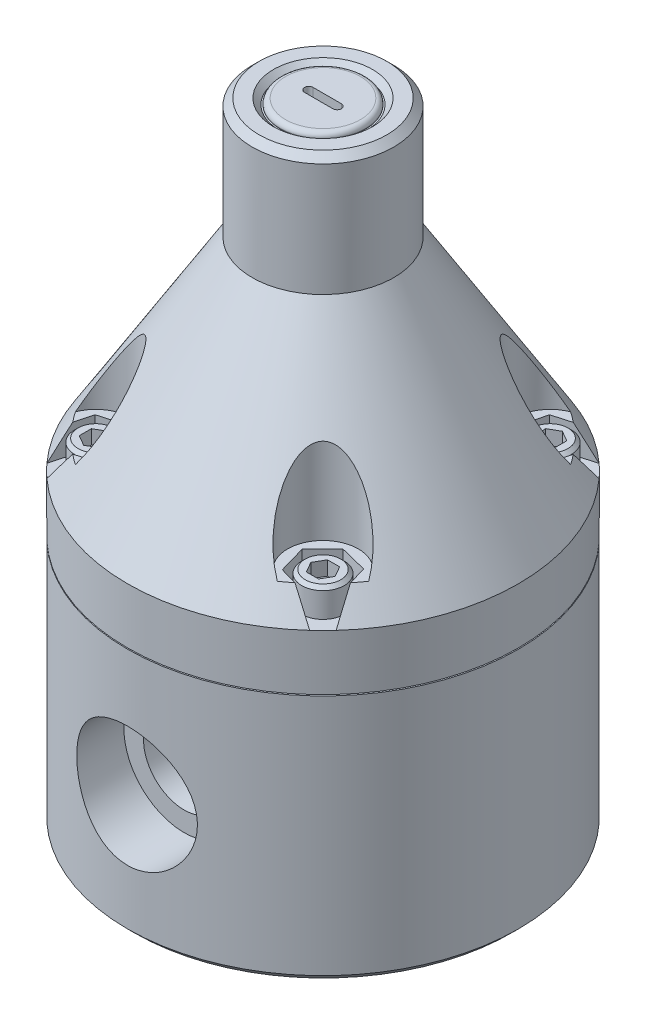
from build123d import *

# Parameters (mm, degrees)
SKETCH1_R         = 43.815
EXTRUDE1_DEPTH    = 140.97
SKETCH3_R         = 11.1125
EXTRUDE2_DEPTH    = 1.27
EXTRUDE2_DRAFT    = -45
CHAMFER1_SIZE     = 1.5748
SKETCH4_R         = 9.525
EXTRUDE3_DEPTH    = 1.27
FILLET1_R         = 1.143
EXTRUDE4_DEPTH    = 3.302
EXTRUDE4_DRAFT    = -1
SKETCH6_R         = 7.9375
EXTRUDE5_DEPTH    = 22.86
EXTRUDE6_DEPTH    = 6.35
CIRPATTERN1_COUNT = 4
SKETCH9_R         = 4.7625
EXTRUDE7_DEPTH    = 6.35
EXTRUDE8_DEPTH    = 3.175
CIRPATTERN2_COUNT = 4
CHAMFER2_SIZE     = 0.762


with BuildPart() as part:
    # Sketch1 → Extrude1 (new body)
    with BuildSketch(Plane(origin=(0, 0, 0), x_dir=(1, 0, 0), z_dir=(0, 1, 0))):
        with Locations(Location((0, 0, 0), (0, 0, 270))):
            Circle(SKETCH1_R)
    extrude(amount=EXTRUDE1_DEPTH)

    # Sketch2 → Cut-Revolve1 (revolve, cut)
    with BuildSketch(Plane.XY, mode=Mode.PRIVATE) as cut_revolve1_sk:
        Polygon((-43.815, 56.134), (-43.815, 68.58), (-15.875, 114.046), (-15.875, 147.034008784), (-49.44729897, 147.034008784), (-49.44729897, 55.88), (-30.226, 55.88), (-30.226, 56.134), align=None)
    revolve(cut_revolve1_sk.sketch.rotate(Axis((0, 0, 0), (0, 1, 0)), 270), axis=Axis((0, 0, 0), (0, 1, 0)), mode=Mode.SUBTRACT)


with BuildPart() as extrude2_tool:
    # Sketch3 → Extrude2 (with draft: the straight prism first)
    with BuildSketch(Plane(origin=(0, 140.97, 0), x_dir=(-1, 0, 0), z_dir=(0, 1, 0))):
        Circle(SKETCH3_R)
    extrude(amount=-EXTRUDE2_DEPTH)
    # Extrude2: the draft: its side faces are tilted about the plane it starts from
    extrude2_sides = [extrude2_tool.faces().sort_by_distance(p)[0] for p in [
        (11.1125, 140.335, 0),
    ]]
    draft(extrude2_sides, Plane(origin=(0, 140.97, 0), x_dir=(-1, 0, 0), z_dir=(0, 1, 0)), EXTRUDE2_DRAFT)


with BuildPart() as part_1:
    add(part.part)

    # Extrude2: cut by extrude2_tool
    add(extrude2_tool.part, mode=Mode.SUBTRACT)

    # Chamfer1
    chamfer1_edges = [part_1.edges().sort_by_distance(p)[0] for p in [
        (0, 0, -43.815),
        (0, 140.97, 15.875),
    ]]
    chamfer(chamfer1_edges, length=CHAMFER1_SIZE)

    # Sketch4 → Extrude3 (add)
    with BuildSketch(Plane(origin=(0, 140.97, 0), x_dir=(-1, 0, 0), z_dir=(0, 1, 0))):
        with Locations(Location((0, 0, 0), (0, 0, 90))):
            Circle(SKETCH4_R)
    extrude(amount=-EXTRUDE3_DEPTH)

    # Fillet1
    fillet1_edges = [part_1.edges().sort_by_distance(p)[0] for p in [
        (0, 140.97, -9.525),
    ]]
    fillet(fillet1_edges, radius=FILLET1_R)


with BuildPart() as extrude4_tool:
    # Sketch5 → Extrude4 (with draft: the straight prism first)
    with BuildSketch(Plane(origin=(0, 140.97, 0), x_dir=(-1, 0, 0), z_dir=(0, 1, 0))):
        with BuildLine():
            Line((3.175, 0.9652), (-3.175, 0.9652))
            ThreePointArc((-3.175, 0.9652), (-4.1402, 0), (-3.175, -0.9652))
            Line((-3.175, -0.9652), (3.175, -0.9652))
            ThreePointArc((3.175, -0.9652), (4.1402, 0), (3.175, 0.9652))
        make_face()
    extrude(amount=-EXTRUDE4_DEPTH)
    # Extrude4: the draft: its side faces are tilted about the plane it starts from
    extrude4_sides = [extrude4_tool.faces().sort_by_distance(p)[0] for p in [
        (-4.1402, 139.319, 0),
        (0, 139.319, 0.9652),
        (4.1402, 139.319, 0),
        (0, 139.319, -0.9652),
    ]]
    draft(extrude4_sides, Plane(origin=(0, 140.97, 0), x_dir=(-1, 0, 0), z_dir=(0, 1, 0)), EXTRUDE4_DRAFT)


with BuildPart() as part_2:
    add(part_1.part)

    # Extrude4: cut by extrude4_tool
    add(extrude4_tool.part, mode=Mode.SUBTRACT)

    # Sketch6 → Extrude5 (cut)
    with BuildSketch(Plane(origin=(0, 74.93, 0), x_dir=(-1, 0, 0), z_dir=(0, 1, 0))):
        with Locations((-25.459026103, 25.459026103)):
            Circle(SKETCH6_R)
    extrude5 = extrude(amount=EXTRUDE5_DEPTH, mode=Mode.SUBTRACT)

    # Sketch8 → Extrude6 (cut)
    with BuildSketch(Plane(origin=(0, 74.93, 0), x_dir=(-1, 0, 0), z_dir=(0, 1, 0))):
        Polygon((-29.948607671, 20.824591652), (-23.690278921, 19.253717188), (-19.200697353, 23.888151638), (-20.969444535, 30.093460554), (-33.591654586, 33.591654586), align=None)
    extrude6 = extrude(amount=-EXTRUDE6_DEPTH, mode=Mode.SUBTRACT)

    # CirPattern1: Extrude5, Extrude6 ×4 about axis
    cirpattern1_axis = Axis((0, 0, 0), (0, 1, 0))
    add([extrude5.rotate(cirpattern1_axis, i * 360 / CIRPATTERN1_COUNT) for i in range(1, CIRPATTERN1_COUNT)], mode=Mode.SUBTRACT)
    add([extrude6.rotate(cirpattern1_axis, i * 360 / CIRPATTERN1_COUNT) for i in range(1, CIRPATTERN1_COUNT)], mode=Mode.SUBTRACT)

    # Sketch9 → Extrude7 (add)
    with BuildSketch(Plane(origin=(0, 74.93, 0), x_dir=(-1, 0, 0), z_dir=(0, 1, 0))):
        with Locations(Location((-25.459026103, 25.459026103, 0), (0, 0, 90))):
            Circle(SKETCH9_R)
    extrude7 = extrude(amount=-EXTRUDE7_DEPTH)

    # Sketch10 → Extrude8 (cut)
    with BuildSketch(Plane(origin=(0, 74.93, 0), x_dir=(-1, 0, 0), z_dir=(0, 1, 0))):
        Polygon((-28.187127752, 25.459026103), (-26.823076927, 23.096420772), (-24.094975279, 23.096420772), (-22.730924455, 25.459026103), (-24.094975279, 27.821631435), (-26.823076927, 27.821631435), align=None)
    extrude8 = extrude(amount=-EXTRUDE8_DEPTH, mode=Mode.SUBTRACT)

    # CirPattern2: Extrude7, Extrude8 ×4 about axis
    cirpattern2_axis = Axis((0, 0, 0), (0, 1, 0))
    add([extrude7.rotate(cirpattern2_axis, i * 360 / CIRPATTERN2_COUNT) for i in range(1, CIRPATTERN2_COUNT)])
    add([extrude8.rotate(cirpattern2_axis, i * 360 / CIRPATTERN2_COUNT) for i in range(1, CIRPATTERN2_COUNT)], mode=Mode.SUBTRACT)

    # Chamfer2
    chamfer2_edges = [part_2.edges().sort_by_distance(p)[0] for p in [
        (25.459026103, 74.93, 20.696526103),
        (-20.696526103, 74.93, 25.459026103),
        (-25.459026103, 74.93, -20.696526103),
        (20.696526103, 74.93, -25.459026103),
    ]]
    chamfer(chamfer2_edges, length=CHAMFER2_SIZE)

    # Sketch14 → CBORE for _00 Binding Head Machine Screw (revolve, cut)
    with BuildSketch(Plane(origin=(0, 27.432, 43.815), x_dir=(0, -1, 0), z_dir=(1, 0, 0))):
        Polygon((0, 0), (0, 23.596366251), (9.1186, 19.05), (9.1186, 12.7), (13.5255, 12.7), (13.5255, 0), align=None)
    cbore_for_00_binding_head_machine_screw = revolve(axis=Axis((0, 27.432, 50.165), (0, 0, -1)), mode=Mode.SUBTRACT)

    # Mirror1: CBORE for _00 Binding Head Machine Screw across plane
    add(cbore_for_00_binding_head_machine_screw.mirror(Plane.XY), mode=Mode.SUBTRACT)


solid = part_2.part
